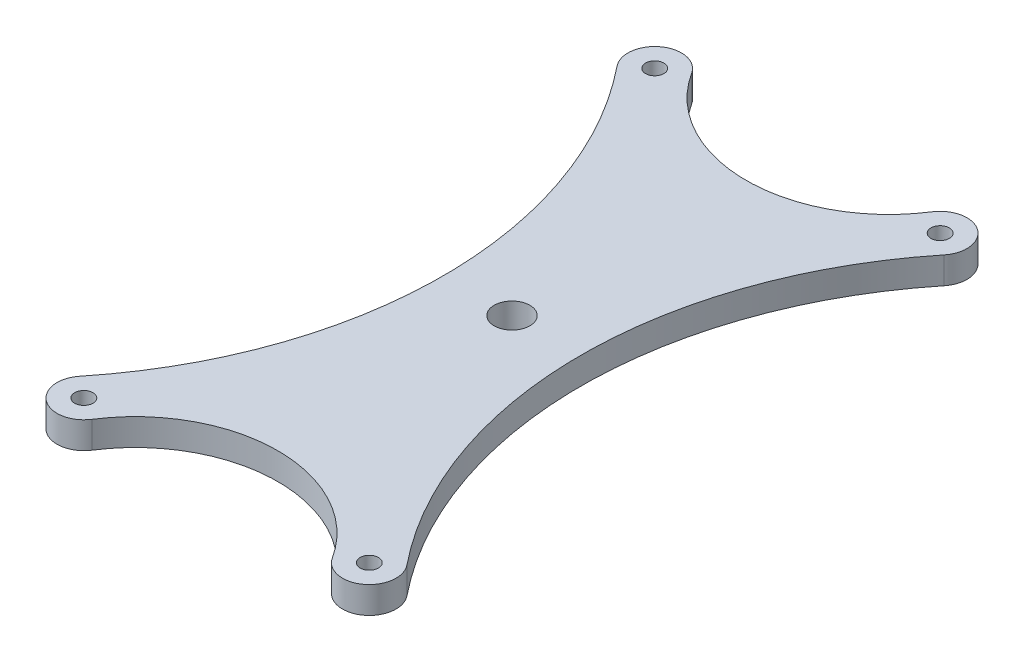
ISO-10303-21;
HEADER;
FILE_DESCRIPTION(('STEP AP214'),'2;1');
FILE_NAME('part.step','',(''),(''),'','','');
FILE_SCHEMA(('AUTOMOTIVE_DESIGN { 1 0 10303 214 1 1 1 1 }'));
ENDSEC;
DATA;
#1=APPLICATION_CONTEXT('core data for automotive mechanical design processes');
#2=APPLICATION_PROTOCOL_DEFINITION('international standard','automotive_design',2000,#1);
#3=PRODUCT_CONTEXT('',#1,'mechanical');
#4=PRODUCT('Part','Part','',(#3));
#5=PRODUCT_RELATED_PRODUCT_CATEGORY('part','',(#4));
#6=PRODUCT_DEFINITION_FORMATION('','',#4);
#7=PRODUCT_DEFINITION_CONTEXT('part definition',#1,'design');
#8=PRODUCT_DEFINITION('design','',#6,#7);
#9=PRODUCT_DEFINITION_SHAPE('','',#8);
#10=(LENGTH_UNIT() NAMED_UNIT(*) SI_UNIT(.MILLI.,.METRE.));
#11=(NAMED_UNIT(*) PLANE_ANGLE_UNIT() SI_UNIT($,.RADIAN.));
#12=(NAMED_UNIT(*) SI_UNIT($,.STERADIAN.) SOLID_ANGLE_UNIT());
#13=UNCERTAINTY_MEASURE_WITH_UNIT(LENGTH_MEASURE(1.E-05),#10,'distance_accuracy_value','');
#14=(GEOMETRIC_REPRESENTATION_CONTEXT(3) GLOBAL_UNCERTAINTY_ASSIGNED_CONTEXT((#13)) GLOBAL_UNIT_ASSIGNED_CONTEXT((#10,
#11,#12)) REPRESENTATION_CONTEXT('',''));
#15=CARTESIAN_POINT('',(0.,0.,0.));
#16=DIRECTION('',(0.,0.,1.));
#17=DIRECTION('',(1.,0.,0.));
#18=AXIS2_PLACEMENT_3D('',#15,#16,#17);
#19=CARTESIAN_POINT('',(-113.841941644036,9.525,50.8));
#20=DIRECTION('',(0.,-1.,0.));
#21=DIRECTION('',(0.,0.,-1.));
#22=AXIS2_PLACEMENT_3D('',#19,#20,#21);
#23=PLANE('',#22);
#24=CARTESIAN_POINT('',(-176.883883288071,9.525,0.));
#25=DIRECTION('',(0.,-1.,0.));
#26=DIRECTION('',(0.,0.,-1.));
#27=AXIS2_PLACEMENT_3D('',#24,#25,#26);
#28=CIRCLE('',#27,152.4);
#29=CARTESIAN_POINT('',(-58.2166990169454,9.525,-95.6235294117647));
#30=VERTEX_POINT('',#29);
#31=CARTESIAN_POINT('',(-58.2166990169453,9.525,95.6235294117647));
#32=VERTEX_POINT('',#31);
#33=EDGE_CURVE('E145',#30,#32,#28,.T.);
#34=ORIENTED_EDGE('',*,*,#33,.T.);
#35=CARTESIAN_POINT('',(-50.8,9.525,101.6));
#36=DIRECTION('',(0.,1.,0.));
#37=DIRECTION('',(0.,0.,1.));
#38=AXIS2_PLACEMENT_3D('',#35,#36,#37);
#39=CIRCLE('',#38,9.525);
#40=CARTESIAN_POINT('',(-42.778947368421,9.525,106.736958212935));
#41=VERTEX_POINT('',#40);
#42=EDGE_CURVE('E93',#32,#41,#39,.T.);
#43=ORIENTED_EDGE('',*,*,#42,.T.);
#44=CARTESIAN_POINT('',(0.,9.525,134.134068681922));
#45=DIRECTION('',(0.,-1.,0.));
#46=DIRECTION('',(0.,0.,-1.));
#47=AXIS2_PLACEMENT_3D('',#44,#45,#46);
#48=CIRCLE('',#47,50.8);
#49=CARTESIAN_POINT('',(42.7789473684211,9.525,106.736958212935));
#50=VERTEX_POINT('',#49);
#51=EDGE_CURVE('E160',#41,#50,#48,.T.);
#52=ORIENTED_EDGE('',*,*,#51,.T.);
#53=CARTESIAN_POINT('',(50.8,9.525,101.6));
#54=DIRECTION('',(0.,1.,0.));
#55=DIRECTION('',(0.,0.,1.));
#56=AXIS2_PLACEMENT_3D('',#53,#54,#55);
#57=CIRCLE('',#56,9.52499999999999);
#58=CARTESIAN_POINT('',(58.2166990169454,9.525,95.6235294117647));
#59=VERTEX_POINT('',#58);
#60=EDGE_CURVE('E173',#50,#59,#57,.T.);
#61=ORIENTED_EDGE('',*,*,#60,.T.);
#62=CARTESIAN_POINT('',(176.883883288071,9.525,0.));
#63=DIRECTION('',(0.,-1.,0.));
#64=DIRECTION('',(0.,0.,1.));
#65=AXIS2_PLACEMENT_3D('',#62,#63,#64);
#66=CIRCLE('',#65,152.4);
#67=CARTESIAN_POINT('',(58.2166990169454,9.525,-95.6235294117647));
#68=VERTEX_POINT('',#67);
#69=EDGE_CURVE('E112',#59,#68,#66,.T.);
#70=ORIENTED_EDGE('',*,*,#69,.T.);
#71=CARTESIAN_POINT('',(50.8,9.525,-101.6));
#72=DIRECTION('',(0.,1.,0.));
#73=DIRECTION('',(0.,0.,1.));
#74=AXIS2_PLACEMENT_3D('',#71,#72,#73);
#75=CIRCLE('',#74,9.525);
#76=CARTESIAN_POINT('',(42.7789473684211,9.525,-106.736958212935));
#77=VERTEX_POINT('',#76);
#78=EDGE_CURVE('E106',#68,#77,#75,.T.);
#79=ORIENTED_EDGE('',*,*,#78,.T.);
#80=CARTESIAN_POINT('',(0.,9.525,-134.134068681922));
#81=DIRECTION('',(0.,-1.,0.));
#82=DIRECTION('',(0.,0.,1.));
#83=AXIS2_PLACEMENT_3D('',#80,#81,#82);
#84=CIRCLE('',#83,50.8);
#85=CARTESIAN_POINT('',(-42.7789473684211,9.525,-106.736958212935));
#86=VERTEX_POINT('',#85);
#87=EDGE_CURVE('E110',#77,#86,#84,.T.);
#88=ORIENTED_EDGE('',*,*,#87,.T.);
#89=CARTESIAN_POINT('',(-50.8,9.525,-101.6));
#90=DIRECTION('',(0.,1.,0.));
#91=DIRECTION('',(0.,0.,1.));
#92=AXIS2_PLACEMENT_3D('',#89,#90,#91);
#93=CIRCLE('',#92,9.525);
#94=EDGE_CURVE('E50',#86,#30,#93,.T.);
#95=ORIENTED_EDGE('',*,*,#94,.T.);
#96=EDGE_LOOP('',(#34,#43,#52,#61,#70,#79,#88,#95));
#97=FACE_BOUND('',#96,.T.);
#98=CARTESIAN_POINT('',(-50.8,9.525,-101.6));
#99=DIRECTION('',(0.,1.,0.));
#100=DIRECTION('',(0.,0.,1.));
#101=AXIS2_PLACEMENT_3D('',#98,#99,#100);
#102=CIRCLE('',#101,3.2639);
#103=CARTESIAN_POINT('',(-50.8,9.525,-104.8639));
#104=VERTEX_POINT('',#103);
#105=EDGE_CURVE('E134',#104,#104,#102,.T.);
#106=ORIENTED_EDGE('',*,*,#105,.F.);
#107=EDGE_LOOP('',(#106));
#108=FACE_BOUND('',#107,.T.);
#109=CARTESIAN_POINT('',(50.8,9.525,-101.6));
#110=DIRECTION('',(0.,1.,0.));
#111=DIRECTION('',(0.,0.,1.));
#112=AXIS2_PLACEMENT_3D('',#109,#110,#111);
#113=CIRCLE('',#112,3.2639);
#114=CARTESIAN_POINT('',(50.8,9.525,-104.8639));
#115=VERTEX_POINT('',#114);
#116=EDGE_CURVE('E182',#115,#115,#113,.T.);
#117=ORIENTED_EDGE('',*,*,#116,.F.);
#118=EDGE_LOOP('',(#117));
#119=FACE_BOUND('',#118,.T.);
#120=CARTESIAN_POINT('',(-50.8,9.525,101.6));
#121=DIRECTION('',(0.,1.,0.));
#122=DIRECTION('',(0.,0.,1.));
#123=AXIS2_PLACEMENT_3D('',#120,#121,#122);
#124=CIRCLE('',#123,3.2639);
#125=CARTESIAN_POINT('',(-50.8,9.525,98.3361));
#126=VERTEX_POINT('',#125);
#127=EDGE_CURVE('E188',#126,#126,#124,.T.);
#128=ORIENTED_EDGE('',*,*,#127,.F.);
#129=EDGE_LOOP('',(#128));
#130=FACE_BOUND('',#129,.T.);
#131=CARTESIAN_POINT('',(50.8,9.525,101.6));
#132=DIRECTION('',(0.,1.,0.));
#133=DIRECTION('',(0.,0.,1.));
#134=AXIS2_PLACEMENT_3D('',#131,#132,#133);
#135=CIRCLE('',#134,3.2639);
#136=CARTESIAN_POINT('',(50.8,9.525,98.3361));
#137=VERTEX_POINT('',#136);
#138=EDGE_CURVE('E194',#137,#137,#135,.T.);
#139=ORIENTED_EDGE('',*,*,#138,.F.);
#140=EDGE_LOOP('',(#139));
#141=FACE_BOUND('',#140,.T.);
#142=CARTESIAN_POINT('',(0.,9.525,0.));
#143=DIRECTION('',(0.,1.,0.));
#144=DIRECTION('',(0.,0.,1.));
#145=AXIS2_PLACEMENT_3D('',#142,#143,#144);
#146=CIRCLE('',#145,6.35);
#147=CARTESIAN_POINT('',(0.,9.525,-6.35000000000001));
#148=VERTEX_POINT('',#147);
#149=EDGE_CURVE('E200',#148,#148,#146,.T.);
#150=ORIENTED_EDGE('',*,*,#149,.F.);
#151=EDGE_LOOP('',(#150));
#152=FACE_BOUND('',#151,.T.);
#153=ADVANCED_FACE('F33',(#97,#108,#119,#130,#141,#152),#23,.F.);
#154=CARTESIAN_POINT('',(-113.841941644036,0.,50.8));
#155=DIRECTION('',(0.,-1.,0.));
#156=DIRECTION('',(0.,0.,-1.));
#157=AXIS2_PLACEMENT_3D('',#154,#155,#156);
#158=PLANE('',#157);
#159=CARTESIAN_POINT('',(50.8,0.,101.6));
#160=DIRECTION('',(0.,1.,0.));
#161=DIRECTION('',(0.,0.,1.));
#162=AXIS2_PLACEMENT_3D('',#159,#160,#161);
#163=CIRCLE('',#162,3.2639);
#164=CARTESIAN_POINT('',(50.8,0.,98.3361));
#165=VERTEX_POINT('',#164);
#166=EDGE_CURVE('E197',#165,#165,#163,.T.);
#167=ORIENTED_EDGE('',*,*,#166,.T.);
#168=EDGE_LOOP('',(#167));
#169=FACE_BOUND('',#168,.T.);
#170=CARTESIAN_POINT('',(50.8,0.,-101.6));
#171=DIRECTION('',(0.,1.,0.));
#172=DIRECTION('',(0.,0.,1.));
#173=AXIS2_PLACEMENT_3D('',#170,#171,#172);
#174=CIRCLE('',#173,3.2639);
#175=CARTESIAN_POINT('',(50.8,0.,-104.8639));
#176=VERTEX_POINT('',#175);
#177=EDGE_CURVE('E185',#176,#176,#174,.T.);
#178=ORIENTED_EDGE('',*,*,#177,.T.);
#179=EDGE_LOOP('',(#178));
#180=FACE_BOUND('',#179,.T.);
#181=CARTESIAN_POINT('',(-176.883883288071,0.,0.));
#182=DIRECTION('',(0.,-1.,0.));
#183=DIRECTION('',(0.,0.,-1.));
#184=AXIS2_PLACEMENT_3D('',#181,#182,#183);
#185=CIRCLE('',#184,152.4);
#186=CARTESIAN_POINT('',(-58.2166990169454,0.,-95.6235294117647));
#187=VERTEX_POINT('',#186);
#188=CARTESIAN_POINT('',(-58.2166990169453,0.,95.6235294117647));
#189=VERTEX_POINT('',#188);
#190=EDGE_CURVE('E130',#187,#189,#185,.T.);
#191=ORIENTED_EDGE('',*,*,#190,.F.);
#192=CARTESIAN_POINT('',(-50.8,0.,-101.6));
#193=DIRECTION('',(0.,1.,0.));
#194=DIRECTION('',(0.,0.,1.));
#195=AXIS2_PLACEMENT_3D('',#192,#193,#194);
#196=CIRCLE('',#195,9.525);
#197=CARTESIAN_POINT('',(-42.7789473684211,0.,-106.736958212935));
#198=VERTEX_POINT('',#197);
#199=EDGE_CURVE('E85',#198,#187,#196,.T.);
#200=ORIENTED_EDGE('',*,*,#199,.F.);
#201=CARTESIAN_POINT('',(0.,0.,-134.134068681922));
#202=DIRECTION('',(0.,-1.,0.));
#203=DIRECTION('',(0.,0.,1.));
#204=AXIS2_PLACEMENT_3D('',#201,#202,#203);
#205=CIRCLE('',#204,50.8);
#206=CARTESIAN_POINT('',(42.7789473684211,0.,-106.736958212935));
#207=VERTEX_POINT('',#206);
#208=EDGE_CURVE('E79',#207,#198,#205,.T.);
#209=ORIENTED_EDGE('',*,*,#208,.F.);
#210=CARTESIAN_POINT('',(50.8,0.,-101.6));
#211=DIRECTION('',(0.,1.,0.));
#212=DIRECTION('',(0.,0.,1.));
#213=AXIS2_PLACEMENT_3D('',#210,#211,#212);
#214=CIRCLE('',#213,9.525);
#215=CARTESIAN_POINT('',(58.2166990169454,0.,-95.6235294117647));
#216=VERTEX_POINT('',#215);
#217=EDGE_CURVE('E120',#216,#207,#214,.T.);
#218=ORIENTED_EDGE('',*,*,#217,.F.);
#219=CARTESIAN_POINT('',(176.883883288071,0.,0.));
#220=DIRECTION('',(0.,-1.,0.));
#221=DIRECTION('',(0.,0.,1.));
#222=AXIS2_PLACEMENT_3D('',#219,#220,#221);
#223=CIRCLE('',#222,152.4);
#224=CARTESIAN_POINT('',(58.2166990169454,0.,95.6235294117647));
#225=VERTEX_POINT('',#224);
#226=EDGE_CURVE('E140',#225,#216,#223,.T.);
#227=ORIENTED_EDGE('',*,*,#226,.F.);
#228=CARTESIAN_POINT('',(50.8,0.,101.6));
#229=DIRECTION('',(0.,1.,0.));
#230=DIRECTION('',(0.,0.,1.));
#231=AXIS2_PLACEMENT_3D('',#228,#229,#230);
#232=CIRCLE('',#231,9.52499999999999);
#233=CARTESIAN_POINT('',(42.7789473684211,0.,106.736958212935));
#234=VERTEX_POINT('',#233);
#235=EDGE_CURVE('E138',#234,#225,#232,.T.);
#236=ORIENTED_EDGE('',*,*,#235,.F.);
#237=CARTESIAN_POINT('',(0.,0.,134.134068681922));
#238=DIRECTION('',(0.,-1.,0.));
#239=DIRECTION('',(0.,0.,-1.));
#240=AXIS2_PLACEMENT_3D('',#237,#238,#239);
#241=CIRCLE('',#240,50.8);
#242=CARTESIAN_POINT('',(-42.778947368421,0.,106.736958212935));
#243=VERTEX_POINT('',#242);
#244=EDGE_CURVE('E136',#243,#234,#241,.T.);
#245=ORIENTED_EDGE('',*,*,#244,.F.);
#246=CARTESIAN_POINT('',(-50.8,0.,101.6));
#247=DIRECTION('',(0.,1.,0.));
#248=DIRECTION('',(0.,0.,1.));
#249=AXIS2_PLACEMENT_3D('',#246,#247,#248);
#250=CIRCLE('',#249,9.525);
#251=EDGE_CURVE('E133',#189,#243,#250,.T.);
#252=ORIENTED_EDGE('',*,*,#251,.F.);
#253=EDGE_LOOP('',(#191,#200,#209,#218,#227,#236,#245,#252));
#254=FACE_BOUND('',#253,.T.);
#255=CARTESIAN_POINT('',(-50.8,0.,-101.6));
#256=DIRECTION('',(0.,1.,0.));
#257=DIRECTION('',(0.,0.,1.));
#258=AXIS2_PLACEMENT_3D('',#255,#256,#257);
#259=CIRCLE('',#258,3.2639);
#260=CARTESIAN_POINT('',(-50.8,0.,-104.8639));
#261=VERTEX_POINT('',#260);
#262=EDGE_CURVE('E179',#261,#261,#259,.T.);
#263=ORIENTED_EDGE('',*,*,#262,.T.);
#264=EDGE_LOOP('',(#263));
#265=FACE_BOUND('',#264,.T.);
#266=CARTESIAN_POINT('',(-50.8,0.,101.6));
#267=DIRECTION('',(0.,1.,0.));
#268=DIRECTION('',(0.,0.,1.));
#269=AXIS2_PLACEMENT_3D('',#266,#267,#268);
#270=CIRCLE('',#269,3.2639);
#271=CARTESIAN_POINT('',(-50.8,0.,98.3361));
#272=VERTEX_POINT('',#271);
#273=EDGE_CURVE('E191',#272,#272,#270,.T.);
#274=ORIENTED_EDGE('',*,*,#273,.T.);
#275=EDGE_LOOP('',(#274));
#276=FACE_BOUND('',#275,.T.);
#277=CARTESIAN_POINT('',(0.,0.,0.));
#278=DIRECTION('',(0.,1.,0.));
#279=DIRECTION('',(0.,0.,1.));
#280=AXIS2_PLACEMENT_3D('',#277,#278,#279);
#281=CIRCLE('',#280,6.35);
#282=CARTESIAN_POINT('',(0.,0.,-6.35000000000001));
#283=VERTEX_POINT('',#282);
#284=EDGE_CURVE('E203',#283,#283,#281,.T.);
#285=ORIENTED_EDGE('',*,*,#284,.T.);
#286=EDGE_LOOP('',(#285));
#287=FACE_BOUND('',#286,.T.);
#288=ADVANCED_FACE('F164',(#169,#180,#254,#265,#276,#287),#158,.T.);
#289=CARTESIAN_POINT('',(-176.883883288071,9.525,0.));
#290=DIRECTION('',(0.,-1.,0.));
#291=DIRECTION('',(0.,0.,-1.));
#292=AXIS2_PLACEMENT_3D('',#289,#290,#291);
#293=CYLINDRICAL_SURFACE('',#292,152.4);
#294=ORIENTED_EDGE('',*,*,#190,.T.);
#295=DIRECTION('',(0.,-1.,0.));
#296=VECTOR('',#295,1.);
#297=CARTESIAN_POINT('',(-58.2166990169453,9.525,95.6235294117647));
#298=LINE('',#297,#296);
#299=EDGE_CURVE('E11',#32,#189,#298,.T.);
#300=ORIENTED_EDGE('',*,*,#299,.F.);
#301=ORIENTED_EDGE('',*,*,#33,.F.);
#302=DIRECTION('',(0.,-1.,0.));
#303=VECTOR('',#302,1.);
#304=CARTESIAN_POINT('',(-58.2166990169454,9.525,-95.6235294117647));
#305=LINE('',#304,#303);
#306=EDGE_CURVE('E126',#30,#187,#305,.T.);
#307=ORIENTED_EDGE('',*,*,#306,.T.);
#308=EDGE_LOOP('',(#294,#300,#301,#307));
#309=FACE_BOUND('',#308,.T.);
#310=ADVANCED_FACE('F35',(#309),#293,.F.);
#311=CARTESIAN_POINT('',(-50.8,9.525,101.6));
#312=DIRECTION('',(0.,-1.,0.));
#313=DIRECTION('',(0.,0.,-1.));
#314=AXIS2_PLACEMENT_3D('',#311,#312,#313);
#315=CYLINDRICAL_SURFACE('',#314,9.525);
#316=ORIENTED_EDGE('',*,*,#251,.T.);
#317=DIRECTION('',(0.,-1.,0.));
#318=VECTOR('',#317,1.);
#319=CARTESIAN_POINT('',(-42.778947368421,9.525,106.736958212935));
#320=LINE('',#319,#318);
#321=EDGE_CURVE('E42',#41,#243,#320,.T.);
#322=ORIENTED_EDGE('',*,*,#321,.F.);
#323=ORIENTED_EDGE('',*,*,#42,.F.);
#324=ORIENTED_EDGE('',*,*,#299,.T.);
#325=EDGE_LOOP('',(#316,#322,#323,#324));
#326=FACE_BOUND('',#325,.T.);
#327=ADVANCED_FACE('F235',(#326),#315,.T.);
#328=CARTESIAN_POINT('',(0.,9.525,134.134068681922));
#329=DIRECTION('',(0.,-1.,0.));
#330=DIRECTION('',(0.,0.,-1.));
#331=AXIS2_PLACEMENT_3D('',#328,#329,#330);
#332=CYLINDRICAL_SURFACE('',#331,50.8);
#333=ORIENTED_EDGE('',*,*,#244,.T.);
#334=DIRECTION('',(0.,-1.,0.));
#335=VECTOR('',#334,1.);
#336=CARTESIAN_POINT('',(42.7789473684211,9.525,106.736958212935));
#337=LINE('',#336,#335);
#338=EDGE_CURVE('E152',#50,#234,#337,.T.);
#339=ORIENTED_EDGE('',*,*,#338,.F.);
#340=ORIENTED_EDGE('',*,*,#51,.F.);
#341=ORIENTED_EDGE('',*,*,#321,.T.);
#342=EDGE_LOOP('',(#333,#339,#340,#341));
#343=FACE_BOUND('',#342,.T.);
#344=ADVANCED_FACE('F158',(#343),#332,.F.);
#345=CARTESIAN_POINT('',(50.8,9.525,101.6));
#346=DIRECTION('',(0.,-1.,0.));
#347=DIRECTION('',(0.,0.,-1.));
#348=AXIS2_PLACEMENT_3D('',#345,#346,#347);
#349=CYLINDRICAL_SURFACE('',#348,9.52499999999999);
#350=ORIENTED_EDGE('',*,*,#235,.T.);
#351=DIRECTION('',(0.,-1.,0.));
#352=VECTOR('',#351,1.);
#353=CARTESIAN_POINT('',(58.2166990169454,9.525,95.6235294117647));
#354=LINE('',#353,#352);
#355=EDGE_CURVE('E149',#59,#225,#354,.T.);
#356=ORIENTED_EDGE('',*,*,#355,.F.);
#357=ORIENTED_EDGE('',*,*,#60,.F.);
#358=ORIENTED_EDGE('',*,*,#338,.T.);
#359=EDGE_LOOP('',(#350,#356,#357,#358));
#360=FACE_BOUND('',#359,.T.);
#361=ADVANCED_FACE('F169',(#360),#349,.T.);
#362=CARTESIAN_POINT('',(176.883883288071,9.525,0.));
#363=DIRECTION('',(0.,-1.,0.));
#364=DIRECTION('',(0.,0.,-1.));
#365=AXIS2_PLACEMENT_3D('',#362,#363,#364);
#366=CYLINDRICAL_SURFACE('',#365,152.4);
#367=ORIENTED_EDGE('',*,*,#226,.T.);
#368=DIRECTION('',(0.,-1.,0.));
#369=VECTOR('',#368,1.);
#370=CARTESIAN_POINT('',(58.2166990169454,9.525,-95.6235294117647));
#371=LINE('',#370,#369);
#372=EDGE_CURVE('E121',#68,#216,#371,.T.);
#373=ORIENTED_EDGE('',*,*,#372,.F.);
#374=ORIENTED_EDGE('',*,*,#69,.F.);
#375=ORIENTED_EDGE('',*,*,#355,.T.);
#376=EDGE_LOOP('',(#367,#373,#374,#375));
#377=FACE_BOUND('',#376,.T.);
#378=ADVANCED_FACE('F172',(#377),#366,.F.);
#379=CARTESIAN_POINT('',(50.8,9.525,-101.6));
#380=DIRECTION('',(0.,-1.,0.));
#381=DIRECTION('',(0.,0.,-1.));
#382=AXIS2_PLACEMENT_3D('',#379,#380,#381);
#383=CYLINDRICAL_SURFACE('',#382,9.525);
#384=ORIENTED_EDGE('',*,*,#217,.T.);
#385=DIRECTION('',(0.,-1.,0.));
#386=VECTOR('',#385,1.);
#387=CARTESIAN_POINT('',(42.7789473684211,9.525,-106.736958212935));
#388=LINE('',#387,#386);
#389=EDGE_CURVE('E117',#77,#207,#388,.T.);
#390=ORIENTED_EDGE('',*,*,#389,.F.);
#391=ORIENTED_EDGE('',*,*,#78,.F.);
#392=ORIENTED_EDGE('',*,*,#372,.T.);
#393=EDGE_LOOP('',(#384,#390,#391,#392));
#394=FACE_BOUND('',#393,.T.);
#395=ADVANCED_FACE('F118',(#394),#383,.T.);
#396=CARTESIAN_POINT('',(0.,9.525,-134.134068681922));
#397=DIRECTION('',(0.,-1.,0.));
#398=DIRECTION('',(0.,0.,-1.));
#399=AXIS2_PLACEMENT_3D('',#396,#397,#398);
#400=CYLINDRICAL_SURFACE('',#399,50.8);
#401=ORIENTED_EDGE('',*,*,#208,.T.);
#402=DIRECTION('',(0.,-1.,0.));
#403=VECTOR('',#402,1.);
#404=CARTESIAN_POINT('',(-42.7789473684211,9.525,-106.736958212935));
#405=LINE('',#404,#403);
#406=EDGE_CURVE('E122',#86,#198,#405,.T.);
#407=ORIENTED_EDGE('',*,*,#406,.F.);
#408=ORIENTED_EDGE('',*,*,#87,.F.);
#409=ORIENTED_EDGE('',*,*,#389,.T.);
#410=EDGE_LOOP('',(#401,#407,#408,#409));
#411=FACE_BOUND('',#410,.T.);
#412=ADVANCED_FACE('F124',(#411),#400,.F.);
#413=CARTESIAN_POINT('',(-50.8,9.525,-101.6));
#414=DIRECTION('',(0.,-1.,0.));
#415=DIRECTION('',(0.,0.,-1.));
#416=AXIS2_PLACEMENT_3D('',#413,#414,#415);
#417=CYLINDRICAL_SURFACE('',#416,9.525);
#418=ORIENTED_EDGE('',*,*,#199,.T.);
#419=ORIENTED_EDGE('',*,*,#306,.F.);
#420=ORIENTED_EDGE('',*,*,#94,.F.);
#421=ORIENTED_EDGE('',*,*,#406,.T.);
#422=EDGE_LOOP('',(#418,#419,#420,#421));
#423=FACE_BOUND('',#422,.T.);
#424=ADVANCED_FACE('F223',(#423),#417,.T.);
#425=CARTESIAN_POINT('',(-50.8,9.525,-101.6));
#426=DIRECTION('',(0.,-1.,0.));
#427=DIRECTION('',(0.,0.,-1.));
#428=AXIS2_PLACEMENT_3D('',#425,#426,#427);
#429=CYLINDRICAL_SURFACE('',#428,3.2639);
#430=CARTESIAN_POINT('',(-50.8,9.525,-104.8639));
#431=CARTESIAN_POINT('',(-50.8,9.42578125,-104.8639));
#432=CARTESIAN_POINT('',(-50.8,9.3265625,-104.8639));
#433=CARTESIAN_POINT('',(-50.8,9.128125,-104.8639));
#434=CARTESIAN_POINT('',(-50.8,9.02890625,-104.8639));
#435=CARTESIAN_POINT('',(-50.8,8.83046875,-104.8639));
#436=CARTESIAN_POINT('',(-50.8,8.73125,-104.8639));
#437=CARTESIAN_POINT('',(-50.8,8.5328125,-104.8639));
#438=CARTESIAN_POINT('',(-50.8,8.43359375,-104.8639));
#439=CARTESIAN_POINT('',(-50.8,8.23515625,-104.8639));
#440=CARTESIAN_POINT('',(-50.8,8.1359375,-104.8639));
#441=CARTESIAN_POINT('',(-50.8,7.9375,-104.8639));
#442=CARTESIAN_POINT('',(-50.8,7.83828125,-104.8639));
#443=CARTESIAN_POINT('',(-50.8,7.63984375,-104.8639));
#444=CARTESIAN_POINT('',(-50.8,7.540625,-104.8639));
#445=CARTESIAN_POINT('',(-50.8,7.3421875,-104.8639));
#446=CARTESIAN_POINT('',(-50.8,7.24296875,-104.8639));
#447=CARTESIAN_POINT('',(-50.8,7.04453125,-104.8639));
#448=CARTESIAN_POINT('',(-50.8,6.9453125,-104.8639));
#449=CARTESIAN_POINT('',(-50.8,6.746875,-104.8639));
#450=CARTESIAN_POINT('',(-50.8,6.64765625,-104.8639));
#451=CARTESIAN_POINT('',(-50.8,6.44921875,-104.8639));
#452=CARTESIAN_POINT('',(-50.8,6.35,-104.8639));
#453=CARTESIAN_POINT('',(-50.8,6.1515625,-104.8639));
#454=CARTESIAN_POINT('',(-50.8,6.05234375,-104.8639));
#455=CARTESIAN_POINT('',(-50.8,5.85390625,-104.8639));
#456=CARTESIAN_POINT('',(-50.8,5.7546875,-104.8639));
#457=CARTESIAN_POINT('',(-50.8,5.55625,-104.8639));
#458=CARTESIAN_POINT('',(-50.8,5.45703125,-104.8639));
#459=CARTESIAN_POINT('',(-50.8,5.25859375,-104.8639));
#460=CARTESIAN_POINT('',(-50.8,5.159375,-104.8639));
#461=CARTESIAN_POINT('',(-50.8,4.9609375,-104.8639));
#462=CARTESIAN_POINT('',(-50.8,4.86171875,-104.8639));
#463=CARTESIAN_POINT('',(-50.8,4.66328125,-104.8639));
#464=CARTESIAN_POINT('',(-50.8,4.5640625,-104.8639));
#465=CARTESIAN_POINT('',(-50.8,4.365625,-104.8639));
#466=CARTESIAN_POINT('',(-50.8,4.26640625,-104.8639));
#467=CARTESIAN_POINT('',(-50.8,4.06796875,-104.8639));
#468=CARTESIAN_POINT('',(-50.8,3.96875,-104.8639));
#469=CARTESIAN_POINT('',(-50.8,3.7703125,-104.8639));
#470=CARTESIAN_POINT('',(-50.8,3.67109375,-104.8639));
#471=CARTESIAN_POINT('',(-50.8,3.47265625,-104.8639));
#472=CARTESIAN_POINT('',(-50.8,3.3734375,-104.8639));
#473=CARTESIAN_POINT('',(-50.8,3.175,-104.8639));
#474=CARTESIAN_POINT('',(-50.8,3.07578125,-104.8639));
#475=CARTESIAN_POINT('',(-50.8,2.87734375,-104.8639));
#476=CARTESIAN_POINT('',(-50.8,2.778125,-104.8639));
#477=CARTESIAN_POINT('',(-50.8,2.5796875,-104.8639));
#478=CARTESIAN_POINT('',(-50.8,2.48046875,-104.8639));
#479=CARTESIAN_POINT('',(-50.8,2.28203125,-104.8639));
#480=CARTESIAN_POINT('',(-50.8,2.1828125,-104.8639));
#481=CARTESIAN_POINT('',(-50.8,1.984375,-104.8639));
#482=CARTESIAN_POINT('',(-50.8,1.88515625,-104.8639));
#483=CARTESIAN_POINT('',(-50.8,1.68671875,-104.8639));
#484=CARTESIAN_POINT('',(-50.8,1.5875,-104.8639));
#485=CARTESIAN_POINT('',(-50.8,1.3890625,-104.8639));
#486=CARTESIAN_POINT('',(-50.8,1.28984375,-104.8639));
#487=CARTESIAN_POINT('',(-50.8,1.09140625,-104.8639));
#488=CARTESIAN_POINT('',(-50.8,0.992187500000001,-104.8639));
#489=CARTESIAN_POINT('',(-50.8,0.793750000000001,-104.8639));
#490=CARTESIAN_POINT('',(-50.8,0.69453125,-104.8639));
#491=CARTESIAN_POINT('',(-50.8,0.49609375,-104.8639));
#492=CARTESIAN_POINT('',(-50.8,0.396875,-104.8639));
#493=CARTESIAN_POINT('',(-50.8,0.1984375,-104.8639));
#494=CARTESIAN_POINT('',(-50.8,0.0992187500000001,-104.8639));
#495=CARTESIAN_POINT('',(-50.8,0.,-104.8639));
#496=B_SPLINE_CURVE_WITH_KNOTS('',3,(#430,#431,#432,#433,#434,#435,#436,#437,#438,#439,#440,
#441,#442,#443,#444,#445,#446,#447,#448,#449,#450,#451,#452,#453,#454,#455,#456,#457,#458,#459,
#460,#461,#462,#463,#464,#465,#466,#467,#468,#469,#470,#471,#472,#473,#474,#475,#476,#477,#478,
#479,#480,#481,#482,#483,#484,#485,#486,#487,#488,#489,#490,#491,#492,#493,#494,#495),
.UNSPECIFIED.,.F.,.F.,(4,2,2,2,2,2,2,2,2,2,2,2,2,2,2,2,2,2,2,2,2,2,2,2,2,2,2,2,2,2,2,2,4),(0.,
0.29765625,0.5953125,0.892968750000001,1.190625,1.48828125,1.7859375,2.08359375,2.38125,
2.67890625,2.9765625,3.27421875,3.571875,3.86953125,4.1671875,4.46484375,4.7625,5.06015625,
5.3578125,5.65546875,5.953125,6.25078125,6.5484375,6.84609375,7.14375,7.44140625,7.7390625,
8.03671875,8.334375,8.63203125,8.9296875,9.22734375,9.525),.UNSPECIFIED.);
#497=EDGE_CURVE('BSEAM220',#104,#261,#496,.T.);
#498=ORIENTED_EDGE('',*,*,#105,.T.);
#499=ORIENTED_EDGE('',*,*,#262,.F.);
#500=ORIENTED_EDGE('',*,*,#497,.T.);
#501=ORIENTED_EDGE('',*,*,#497,.F.);
#502=EDGE_LOOP('',(#498,#500,#499,#501));
#503=FACE_BOUND('',#502,.T.);
#504=ADVANCED_FACE('F220',(#503),#429,.F.);
#505=CARTESIAN_POINT('',(50.8,9.525,-101.6));
#506=DIRECTION('',(0.,-1.,0.));
#507=DIRECTION('',(0.,0.,-1.));
#508=AXIS2_PLACEMENT_3D('',#505,#506,#507);
#509=CYLINDRICAL_SURFACE('',#508,3.2639);
#510=CARTESIAN_POINT('',(50.8,9.525,-104.8639));
#511=CARTESIAN_POINT('',(50.8,9.42578125,-104.8639));
#512=CARTESIAN_POINT('',(50.8,9.3265625,-104.8639));
#513=CARTESIAN_POINT('',(50.8,9.128125,-104.8639));
#514=CARTESIAN_POINT('',(50.8,9.02890625,-104.8639));
#515=CARTESIAN_POINT('',(50.8,8.83046875,-104.8639));
#516=CARTESIAN_POINT('',(50.8,8.73125,-104.8639));
#517=CARTESIAN_POINT('',(50.8,8.5328125,-104.8639));
#518=CARTESIAN_POINT('',(50.8,8.43359375,-104.8639));
#519=CARTESIAN_POINT('',(50.8,8.23515625,-104.8639));
#520=CARTESIAN_POINT('',(50.8,8.1359375,-104.8639));
#521=CARTESIAN_POINT('',(50.8,7.9375,-104.8639));
#522=CARTESIAN_POINT('',(50.8,7.83828125,-104.8639));
#523=CARTESIAN_POINT('',(50.8,7.63984375,-104.8639));
#524=CARTESIAN_POINT('',(50.8,7.540625,-104.8639));
#525=CARTESIAN_POINT('',(50.8,7.3421875,-104.8639));
#526=CARTESIAN_POINT('',(50.8,7.24296875,-104.8639));
#527=CARTESIAN_POINT('',(50.8,7.04453125,-104.8639));
#528=CARTESIAN_POINT('',(50.8,6.9453125,-104.8639));
#529=CARTESIAN_POINT('',(50.8,6.746875,-104.8639));
#530=CARTESIAN_POINT('',(50.8,6.64765625,-104.8639));
#531=CARTESIAN_POINT('',(50.8,6.44921875,-104.8639));
#532=CARTESIAN_POINT('',(50.8,6.35,-104.8639));
#533=CARTESIAN_POINT('',(50.8,6.1515625,-104.8639));
#534=CARTESIAN_POINT('',(50.8,6.05234375,-104.8639));
#535=CARTESIAN_POINT('',(50.8,5.85390625,-104.8639));
#536=CARTESIAN_POINT('',(50.8,5.7546875,-104.8639));
#537=CARTESIAN_POINT('',(50.8,5.55625,-104.8639));
#538=CARTESIAN_POINT('',(50.8,5.45703125,-104.8639));
#539=CARTESIAN_POINT('',(50.8,5.25859375,-104.8639));
#540=CARTESIAN_POINT('',(50.8,5.159375,-104.8639));
#541=CARTESIAN_POINT('',(50.8,4.9609375,-104.8639));
#542=CARTESIAN_POINT('',(50.8,4.86171875,-104.8639));
#543=CARTESIAN_POINT('',(50.8,4.66328125,-104.8639));
#544=CARTESIAN_POINT('',(50.8,4.5640625,-104.8639));
#545=CARTESIAN_POINT('',(50.8,4.365625,-104.8639));
#546=CARTESIAN_POINT('',(50.8,4.26640625,-104.8639));
#547=CARTESIAN_POINT('',(50.8,4.06796875,-104.8639));
#548=CARTESIAN_POINT('',(50.8,3.96875,-104.8639));
#549=CARTESIAN_POINT('',(50.8,3.7703125,-104.8639));
#550=CARTESIAN_POINT('',(50.8,3.67109375,-104.8639));
#551=CARTESIAN_POINT('',(50.8,3.47265625,-104.8639));
#552=CARTESIAN_POINT('',(50.8,3.3734375,-104.8639));
#553=CARTESIAN_POINT('',(50.8,3.175,-104.8639));
#554=CARTESIAN_POINT('',(50.8,3.07578125,-104.8639));
#555=CARTESIAN_POINT('',(50.8,2.87734375,-104.8639));
#556=CARTESIAN_POINT('',(50.8,2.778125,-104.8639));
#557=CARTESIAN_POINT('',(50.8,2.5796875,-104.8639));
#558=CARTESIAN_POINT('',(50.8,2.48046875,-104.8639));
#559=CARTESIAN_POINT('',(50.8,2.28203125,-104.8639));
#560=CARTESIAN_POINT('',(50.8,2.1828125,-104.8639));
#561=CARTESIAN_POINT('',(50.8,1.984375,-104.8639));
#562=CARTESIAN_POINT('',(50.8,1.88515625,-104.8639));
#563=CARTESIAN_POINT('',(50.8,1.68671875,-104.8639));
#564=CARTESIAN_POINT('',(50.8,1.5875,-104.8639));
#565=CARTESIAN_POINT('',(50.8,1.3890625,-104.8639));
#566=CARTESIAN_POINT('',(50.8,1.28984375,-104.8639));
#567=CARTESIAN_POINT('',(50.8,1.09140625,-104.8639));
#568=CARTESIAN_POINT('',(50.8,0.992187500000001,-104.8639));
#569=CARTESIAN_POINT('',(50.8,0.793750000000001,-104.8639));
#570=CARTESIAN_POINT('',(50.8,0.69453125,-104.8639));
#571=CARTESIAN_POINT('',(50.8,0.49609375,-104.8639));
#572=CARTESIAN_POINT('',(50.8,0.396875,-104.8639));
#573=CARTESIAN_POINT('',(50.8,0.1984375,-104.8639));
#574=CARTESIAN_POINT('',(50.8,0.0992187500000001,-104.8639));
#575=CARTESIAN_POINT('',(50.8,0.,-104.8639));
#576=B_SPLINE_CURVE_WITH_KNOTS('',3,(#510,#511,#512,#513,#514,#515,#516,#517,#518,#519,#520,
#521,#522,#523,#524,#525,#526,#527,#528,#529,#530,#531,#532,#533,#534,#535,#536,#537,#538,#539,
#540,#541,#542,#543,#544,#545,#546,#547,#548,#549,#550,#551,#552,#553,#554,#555,#556,#557,#558,
#559,#560,#561,#562,#563,#564,#565,#566,#567,#568,#569,#570,#571,#572,#573,#574,#575),
.UNSPECIFIED.,.F.,.F.,(4,2,2,2,2,2,2,2,2,2,2,2,2,2,2,2,2,2,2,2,2,2,2,2,2,2,2,2,2,2,2,2,4),(0.,
0.29765625,0.5953125,0.892968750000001,1.190625,1.48828125,1.7859375,2.08359375,2.38125,
2.67890625,2.9765625,3.27421875,3.571875,3.86953125,4.1671875,4.46484375,4.7625,5.06015625,
5.3578125,5.65546875,5.953125,6.25078125,6.5484375,6.84609375,7.14375,7.44140625,7.7390625,
8.03671875,8.334375,8.63203125,8.9296875,9.22734375,9.525),.UNSPECIFIED.);
#577=EDGE_CURVE('BSEAM299',#115,#176,#576,.T.);
#578=ORIENTED_EDGE('',*,*,#116,.T.);
#579=ORIENTED_EDGE('',*,*,#177,.F.);
#580=ORIENTED_EDGE('',*,*,#577,.T.);
#581=ORIENTED_EDGE('',*,*,#577,.F.);
#582=EDGE_LOOP('',(#578,#580,#579,#581));
#583=FACE_BOUND('',#582,.T.);
#584=ADVANCED_FACE('F299',(#583),#509,.F.);
#585=CARTESIAN_POINT('',(-50.8,9.525,101.6));
#586=DIRECTION('',(0.,-1.,0.));
#587=DIRECTION('',(0.,0.,-1.));
#588=AXIS2_PLACEMENT_3D('',#585,#586,#587);
#589=CYLINDRICAL_SURFACE('',#588,3.2639);
#590=CARTESIAN_POINT('',(-50.8,9.525,98.3361));
#591=CARTESIAN_POINT('',(-50.8,9.42578125,98.3361));
#592=CARTESIAN_POINT('',(-50.8,9.3265625,98.3361));
#593=CARTESIAN_POINT('',(-50.8,9.128125,98.3361));
#594=CARTESIAN_POINT('',(-50.8,9.02890625,98.3361));
#595=CARTESIAN_POINT('',(-50.8,8.83046875,98.3361));
#596=CARTESIAN_POINT('',(-50.8,8.73125,98.3361));
#597=CARTESIAN_POINT('',(-50.8,8.5328125,98.3361));
#598=CARTESIAN_POINT('',(-50.8,8.43359375,98.3361));
#599=CARTESIAN_POINT('',(-50.8,8.23515625,98.3361));
#600=CARTESIAN_POINT('',(-50.8,8.1359375,98.3361));
#601=CARTESIAN_POINT('',(-50.8,7.9375,98.3361));
#602=CARTESIAN_POINT('',(-50.8,7.83828125,98.3361));
#603=CARTESIAN_POINT('',(-50.8,7.63984375,98.3361));
#604=CARTESIAN_POINT('',(-50.8,7.540625,98.3361));
#605=CARTESIAN_POINT('',(-50.8,7.3421875,98.3361));
#606=CARTESIAN_POINT('',(-50.8,7.24296875,98.3361));
#607=CARTESIAN_POINT('',(-50.8,7.04453125,98.3361));
#608=CARTESIAN_POINT('',(-50.8,6.9453125,98.3361));
#609=CARTESIAN_POINT('',(-50.8,6.746875,98.3361));
#610=CARTESIAN_POINT('',(-50.8,6.64765625,98.3361));
#611=CARTESIAN_POINT('',(-50.8,6.44921875,98.3361));
#612=CARTESIAN_POINT('',(-50.8,6.35,98.3361));
#613=CARTESIAN_POINT('',(-50.8,6.1515625,98.3361));
#614=CARTESIAN_POINT('',(-50.8,6.05234375,98.3361));
#615=CARTESIAN_POINT('',(-50.8,5.85390625,98.3361));
#616=CARTESIAN_POINT('',(-50.8,5.7546875,98.3361));
#617=CARTESIAN_POINT('',(-50.8,5.55625,98.3361));
#618=CARTESIAN_POINT('',(-50.8,5.45703125,98.3361));
#619=CARTESIAN_POINT('',(-50.8,5.25859375,98.3361));
#620=CARTESIAN_POINT('',(-50.8,5.159375,98.3361));
#621=CARTESIAN_POINT('',(-50.8,4.9609375,98.3361));
#622=CARTESIAN_POINT('',(-50.8,4.86171875,98.3361));
#623=CARTESIAN_POINT('',(-50.8,4.66328125,98.3361));
#624=CARTESIAN_POINT('',(-50.8,4.5640625,98.3361));
#625=CARTESIAN_POINT('',(-50.8,4.365625,98.3361));
#626=CARTESIAN_POINT('',(-50.8,4.26640625,98.3361));
#627=CARTESIAN_POINT('',(-50.8,4.06796875,98.3361));
#628=CARTESIAN_POINT('',(-50.8,3.96875,98.3361));
#629=CARTESIAN_POINT('',(-50.8,3.7703125,98.3361));
#630=CARTESIAN_POINT('',(-50.8,3.67109375,98.3361));
#631=CARTESIAN_POINT('',(-50.8,3.47265625,98.3361));
#632=CARTESIAN_POINT('',(-50.8,3.3734375,98.3361));
#633=CARTESIAN_POINT('',(-50.8,3.175,98.3361));
#634=CARTESIAN_POINT('',(-50.8,3.07578125,98.3361));
#635=CARTESIAN_POINT('',(-50.8,2.87734375,98.3361));
#636=CARTESIAN_POINT('',(-50.8,2.778125,98.3361));
#637=CARTESIAN_POINT('',(-50.8,2.5796875,98.3361));
#638=CARTESIAN_POINT('',(-50.8,2.48046875,98.3361));
#639=CARTESIAN_POINT('',(-50.8,2.28203125,98.3361));
#640=CARTESIAN_POINT('',(-50.8,2.1828125,98.3361));
#641=CARTESIAN_POINT('',(-50.8,1.984375,98.3361));
#642=CARTESIAN_POINT('',(-50.8,1.88515625,98.3361));
#643=CARTESIAN_POINT('',(-50.8,1.68671875,98.3361));
#644=CARTESIAN_POINT('',(-50.8,1.5875,98.3361));
#645=CARTESIAN_POINT('',(-50.8,1.3890625,98.3361));
#646=CARTESIAN_POINT('',(-50.8,1.28984375,98.3361));
#647=CARTESIAN_POINT('',(-50.8,1.09140625,98.3361));
#648=CARTESIAN_POINT('',(-50.8,0.992187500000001,98.3361));
#649=CARTESIAN_POINT('',(-50.8,0.793750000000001,98.3361));
#650=CARTESIAN_POINT('',(-50.8,0.69453125,98.3361));
#651=CARTESIAN_POINT('',(-50.8,0.49609375,98.3361));
#652=CARTESIAN_POINT('',(-50.8,0.396875,98.3361));
#653=CARTESIAN_POINT('',(-50.8,0.1984375,98.3361));
#654=CARTESIAN_POINT('',(-50.8,0.0992187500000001,98.3361));
#655=CARTESIAN_POINT('',(-50.8,0.,98.3361));
#656=B_SPLINE_CURVE_WITH_KNOTS('',3,(#590,#591,#592,#593,#594,#595,#596,#597,#598,#599,#600,
#601,#602,#603,#604,#605,#606,#607,#608,#609,#610,#611,#612,#613,#614,#615,#616,#617,#618,#619,
#620,#621,#622,#623,#624,#625,#626,#627,#628,#629,#630,#631,#632,#633,#634,#635,#636,#637,#638,
#639,#640,#641,#642,#643,#644,#645,#646,#647,#648,#649,#650,#651,#652,#653,#654,#655),
.UNSPECIFIED.,.F.,.F.,(4,2,2,2,2,2,2,2,2,2,2,2,2,2,2,2,2,2,2,2,2,2,2,2,2,2,2,2,2,2,2,2,4),(0.,
0.29765625,0.5953125,0.892968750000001,1.190625,1.48828125,1.7859375,2.08359375,2.38125,
2.67890625,2.9765625,3.27421875,3.571875,3.86953125,4.1671875,4.46484375,4.7625,5.06015625,
5.3578125,5.65546875,5.953125,6.25078125,6.5484375,6.84609375,7.14375,7.44140625,7.7390625,
8.03671875,8.334375,8.63203125,8.9296875,9.22734375,9.525),.UNSPECIFIED.);
#657=EDGE_CURVE('BSEAM307',#126,#272,#656,.T.);
#658=ORIENTED_EDGE('',*,*,#127,.T.);
#659=ORIENTED_EDGE('',*,*,#273,.F.);
#660=ORIENTED_EDGE('',*,*,#657,.T.);
#661=ORIENTED_EDGE('',*,*,#657,.F.);
#662=EDGE_LOOP('',(#658,#660,#659,#661));
#663=FACE_BOUND('',#662,.T.);
#664=ADVANCED_FACE('F307',(#663),#589,.F.);
#665=CARTESIAN_POINT('',(50.8,9.525,101.6));
#666=DIRECTION('',(0.,-1.,0.));
#667=DIRECTION('',(0.,0.,-1.));
#668=AXIS2_PLACEMENT_3D('',#665,#666,#667);
#669=CYLINDRICAL_SURFACE('',#668,3.2639);
#670=CARTESIAN_POINT('',(50.8,9.525,98.3361));
#671=CARTESIAN_POINT('',(50.8,9.42578125,98.3361));
#672=CARTESIAN_POINT('',(50.8,9.3265625,98.3361));
#673=CARTESIAN_POINT('',(50.8,9.128125,98.3361));
#674=CARTESIAN_POINT('',(50.8,9.02890625,98.3361));
#675=CARTESIAN_POINT('',(50.8,8.83046875,98.3361));
#676=CARTESIAN_POINT('',(50.8,8.73125,98.3361));
#677=CARTESIAN_POINT('',(50.8,8.5328125,98.3361));
#678=CARTESIAN_POINT('',(50.8,8.43359375,98.3361));
#679=CARTESIAN_POINT('',(50.8,8.23515625,98.3361));
#680=CARTESIAN_POINT('',(50.8,8.1359375,98.3361));
#681=CARTESIAN_POINT('',(50.8,7.9375,98.3361));
#682=CARTESIAN_POINT('',(50.8,7.83828125,98.3361));
#683=CARTESIAN_POINT('',(50.8,7.63984375,98.3361));
#684=CARTESIAN_POINT('',(50.8,7.540625,98.3361));
#685=CARTESIAN_POINT('',(50.8,7.3421875,98.3361));
#686=CARTESIAN_POINT('',(50.8,7.24296875,98.3361));
#687=CARTESIAN_POINT('',(50.8,7.04453125,98.3361));
#688=CARTESIAN_POINT('',(50.8,6.9453125,98.3361));
#689=CARTESIAN_POINT('',(50.8,6.746875,98.3361));
#690=CARTESIAN_POINT('',(50.8,6.64765625,98.3361));
#691=CARTESIAN_POINT('',(50.8,6.44921875,98.3361));
#692=CARTESIAN_POINT('',(50.8,6.35,98.3361));
#693=CARTESIAN_POINT('',(50.8,6.1515625,98.3361));
#694=CARTESIAN_POINT('',(50.8,6.05234375,98.3361));
#695=CARTESIAN_POINT('',(50.8,5.85390625,98.3361));
#696=CARTESIAN_POINT('',(50.8,5.7546875,98.3361));
#697=CARTESIAN_POINT('',(50.8,5.55625,98.3361));
#698=CARTESIAN_POINT('',(50.8,5.45703125,98.3361));
#699=CARTESIAN_POINT('',(50.8,5.25859375,98.3361));
#700=CARTESIAN_POINT('',(50.8,5.159375,98.3361));
#701=CARTESIAN_POINT('',(50.8,4.9609375,98.3361));
#702=CARTESIAN_POINT('',(50.8,4.86171875,98.3361));
#703=CARTESIAN_POINT('',(50.8,4.66328125,98.3361));
#704=CARTESIAN_POINT('',(50.8,4.5640625,98.3361));
#705=CARTESIAN_POINT('',(50.8,4.365625,98.3361));
#706=CARTESIAN_POINT('',(50.8,4.26640625,98.3361));
#707=CARTESIAN_POINT('',(50.8,4.06796875,98.3361));
#708=CARTESIAN_POINT('',(50.8,3.96875,98.3361));
#709=CARTESIAN_POINT('',(50.8,3.7703125,98.3361));
#710=CARTESIAN_POINT('',(50.8,3.67109375,98.3361));
#711=CARTESIAN_POINT('',(50.8,3.47265625,98.3361));
#712=CARTESIAN_POINT('',(50.8,3.3734375,98.3361));
#713=CARTESIAN_POINT('',(50.8,3.175,98.3361));
#714=CARTESIAN_POINT('',(50.8,3.07578125,98.3361));
#715=CARTESIAN_POINT('',(50.8,2.87734375,98.3361));
#716=CARTESIAN_POINT('',(50.8,2.778125,98.3361));
#717=CARTESIAN_POINT('',(50.8,2.5796875,98.3361));
#718=CARTESIAN_POINT('',(50.8,2.48046875,98.3361));
#719=CARTESIAN_POINT('',(50.8,2.28203125,98.3361));
#720=CARTESIAN_POINT('',(50.8,2.1828125,98.3361));
#721=CARTESIAN_POINT('',(50.8,1.984375,98.3361));
#722=CARTESIAN_POINT('',(50.8,1.88515625,98.3361));
#723=CARTESIAN_POINT('',(50.8,1.68671875,98.3361));
#724=CARTESIAN_POINT('',(50.8,1.5875,98.3361));
#725=CARTESIAN_POINT('',(50.8,1.3890625,98.3361));
#726=CARTESIAN_POINT('',(50.8,1.28984375,98.3361));
#727=CARTESIAN_POINT('',(50.8,1.09140625,98.3361));
#728=CARTESIAN_POINT('',(50.8,0.992187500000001,98.3361));
#729=CARTESIAN_POINT('',(50.8,0.793750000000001,98.3361));
#730=CARTESIAN_POINT('',(50.8,0.69453125,98.3361));
#731=CARTESIAN_POINT('',(50.8,0.49609375,98.3361));
#732=CARTESIAN_POINT('',(50.8,0.396875,98.3361));
#733=CARTESIAN_POINT('',(50.8,0.1984375,98.3361));
#734=CARTESIAN_POINT('',(50.8,0.0992187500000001,98.3361));
#735=CARTESIAN_POINT('',(50.8,0.,98.3361));
#736=B_SPLINE_CURVE_WITH_KNOTS('',3,(#670,#671,#672,#673,#674,#675,#676,#677,#678,#679,#680,
#681,#682,#683,#684,#685,#686,#687,#688,#689,#690,#691,#692,#693,#694,#695,#696,#697,#698,#699,
#700,#701,#702,#703,#704,#705,#706,#707,#708,#709,#710,#711,#712,#713,#714,#715,#716,#717,#718,
#719,#720,#721,#722,#723,#724,#725,#726,#727,#728,#729,#730,#731,#732,#733,#734,#735),
.UNSPECIFIED.,.F.,.F.,(4,2,2,2,2,2,2,2,2,2,2,2,2,2,2,2,2,2,2,2,2,2,2,2,2,2,2,2,2,2,2,2,4),(0.,
0.29765625,0.5953125,0.892968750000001,1.190625,1.48828125,1.7859375,2.08359375,2.38125,
2.67890625,2.9765625,3.27421875,3.571875,3.86953125,4.1671875,4.46484375,4.7625,5.06015625,
5.3578125,5.65546875,5.953125,6.25078125,6.5484375,6.84609375,7.14375,7.44140625,7.7390625,
8.03671875,8.334375,8.63203125,8.9296875,9.22734375,9.525),.UNSPECIFIED.);
#737=EDGE_CURVE('BSEAM315',#137,#165,#736,.T.);
#738=ORIENTED_EDGE('',*,*,#138,.T.);
#739=ORIENTED_EDGE('',*,*,#166,.F.);
#740=ORIENTED_EDGE('',*,*,#737,.T.);
#741=ORIENTED_EDGE('',*,*,#737,.F.);
#742=EDGE_LOOP('',(#738,#740,#739,#741));
#743=FACE_BOUND('',#742,.T.);
#744=ADVANCED_FACE('F315',(#743),#669,.F.);
#745=CARTESIAN_POINT('',(0.,9.525,0.));
#746=DIRECTION('',(0.,-1.,0.));
#747=DIRECTION('',(0.,0.,-1.));
#748=AXIS2_PLACEMENT_3D('',#745,#746,#747);
#749=CYLINDRICAL_SURFACE('',#748,6.35);
#750=CARTESIAN_POINT('',(0.,9.525,-6.35000000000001));
#751=CARTESIAN_POINT('',(0.,9.42578125,-6.35000000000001));
#752=CARTESIAN_POINT('',(0.,9.3265625,-6.35000000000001));
#753=CARTESIAN_POINT('',(0.,9.128125,-6.35000000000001));
#754=CARTESIAN_POINT('',(0.,9.02890625,-6.35000000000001));
#755=CARTESIAN_POINT('',(0.,8.83046875,-6.35000000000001));
#756=CARTESIAN_POINT('',(0.,8.73125,-6.35000000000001));
#757=CARTESIAN_POINT('',(0.,8.5328125,-6.35000000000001));
#758=CARTESIAN_POINT('',(0.,8.43359375,-6.35000000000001));
#759=CARTESIAN_POINT('',(0.,8.23515625,-6.35000000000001));
#760=CARTESIAN_POINT('',(0.,8.1359375,-6.35000000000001));
#761=CARTESIAN_POINT('',(0.,7.9375,-6.35000000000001));
#762=CARTESIAN_POINT('',(0.,7.83828125,-6.35000000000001));
#763=CARTESIAN_POINT('',(0.,7.63984375,-6.35000000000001));
#764=CARTESIAN_POINT('',(0.,7.540625,-6.35000000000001));
#765=CARTESIAN_POINT('',(0.,7.3421875,-6.35000000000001));
#766=CARTESIAN_POINT('',(0.,7.24296875,-6.35000000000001));
#767=CARTESIAN_POINT('',(0.,7.04453125,-6.35000000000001));
#768=CARTESIAN_POINT('',(0.,6.9453125,-6.35000000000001));
#769=CARTESIAN_POINT('',(0.,6.746875,-6.35000000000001));
#770=CARTESIAN_POINT('',(0.,6.64765625,-6.35000000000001));
#771=CARTESIAN_POINT('',(0.,6.44921875,-6.35000000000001));
#772=CARTESIAN_POINT('',(0.,6.35,-6.35000000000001));
#773=CARTESIAN_POINT('',(0.,6.1515625,-6.35000000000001));
#774=CARTESIAN_POINT('',(0.,6.05234375,-6.35000000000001));
#775=CARTESIAN_POINT('',(0.,5.85390625,-6.35000000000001));
#776=CARTESIAN_POINT('',(0.,5.7546875,-6.35000000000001));
#777=CARTESIAN_POINT('',(0.,5.55625,-6.35000000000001));
#778=CARTESIAN_POINT('',(0.,5.45703125,-6.35000000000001));
#779=CARTESIAN_POINT('',(0.,5.25859375,-6.35000000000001));
#780=CARTESIAN_POINT('',(0.,5.159375,-6.35000000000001));
#781=CARTESIAN_POINT('',(0.,4.9609375,-6.35000000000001));
#782=CARTESIAN_POINT('',(0.,4.86171875,-6.35000000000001));
#783=CARTESIAN_POINT('',(0.,4.66328125,-6.35000000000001));
#784=CARTESIAN_POINT('',(0.,4.5640625,-6.35000000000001));
#785=CARTESIAN_POINT('',(0.,4.365625,-6.35000000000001));
#786=CARTESIAN_POINT('',(0.,4.26640625,-6.35000000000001));
#787=CARTESIAN_POINT('',(0.,4.06796875,-6.35000000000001));
#788=CARTESIAN_POINT('',(0.,3.96875,-6.35000000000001));
#789=CARTESIAN_POINT('',(0.,3.7703125,-6.35000000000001));
#790=CARTESIAN_POINT('',(0.,3.67109375,-6.35000000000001));
#791=CARTESIAN_POINT('',(0.,3.47265625,-6.35000000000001));
#792=CARTESIAN_POINT('',(0.,3.3734375,-6.35000000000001));
#793=CARTESIAN_POINT('',(0.,3.175,-6.35000000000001));
#794=CARTESIAN_POINT('',(0.,3.07578125,-6.35000000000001));
#795=CARTESIAN_POINT('',(0.,2.87734375,-6.35000000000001));
#796=CARTESIAN_POINT('',(0.,2.778125,-6.35000000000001));
#797=CARTESIAN_POINT('',(0.,2.5796875,-6.35000000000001));
#798=CARTESIAN_POINT('',(0.,2.48046875,-6.35000000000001));
#799=CARTESIAN_POINT('',(0.,2.28203125,-6.35000000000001));
#800=CARTESIAN_POINT('',(0.,2.1828125,-6.35000000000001));
#801=CARTESIAN_POINT('',(0.,1.984375,-6.35000000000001));
#802=CARTESIAN_POINT('',(0.,1.88515625,-6.35000000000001));
#803=CARTESIAN_POINT('',(0.,1.68671875,-6.35000000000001));
#804=CARTESIAN_POINT('',(0.,1.5875,-6.35000000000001));
#805=CARTESIAN_POINT('',(0.,1.3890625,-6.35000000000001));
#806=CARTESIAN_POINT('',(0.,1.28984375,-6.35000000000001));
#807=CARTESIAN_POINT('',(0.,1.09140625,-6.35000000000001));
#808=CARTESIAN_POINT('',(0.,0.992187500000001,-6.35000000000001));
#809=CARTESIAN_POINT('',(0.,0.793750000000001,-6.35000000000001));
#810=CARTESIAN_POINT('',(0.,0.69453125,-6.35000000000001));
#811=CARTESIAN_POINT('',(0.,0.49609375,-6.35000000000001));
#812=CARTESIAN_POINT('',(0.,0.396875,-6.35000000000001));
#813=CARTESIAN_POINT('',(0.,0.1984375,-6.35000000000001));
#814=CARTESIAN_POINT('',(0.,0.0992187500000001,-6.35000000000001));
#815=CARTESIAN_POINT('',(0.,0.,-6.35000000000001));
#816=B_SPLINE_CURVE_WITH_KNOTS('',3,(#750,#751,#752,#753,#754,#755,#756,#757,#758,#759,#760,
#761,#762,#763,#764,#765,#766,#767,#768,#769,#770,#771,#772,#773,#774,#775,#776,#777,#778,#779,
#780,#781,#782,#783,#784,#785,#786,#787,#788,#789,#790,#791,#792,#793,#794,#795,#796,#797,#798,
#799,#800,#801,#802,#803,#804,#805,#806,#807,#808,#809,#810,#811,#812,#813,#814,#815),
.UNSPECIFIED.,.F.,.F.,(4,2,2,2,2,2,2,2,2,2,2,2,2,2,2,2,2,2,2,2,2,2,2,2,2,2,2,2,2,2,2,2,4),(0.,
0.297656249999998,0.595312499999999,0.892968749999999,1.190625,1.48828125,1.7859375,2.08359375,
2.38125,2.67890625,2.9765625,3.27421875,3.571875,3.86953125,4.1671875,4.46484375,4.7625,
5.06015625,5.3578125,5.65546875,5.953125,6.25078125,6.5484375,6.84609375,7.14375,7.44140625,
7.7390625,8.03671875,8.334375,8.63203125,8.9296875,9.22734375,9.525),.UNSPECIFIED.);
#817=EDGE_CURVE('BSEAM209',#148,#283,#816,.T.);
#818=ORIENTED_EDGE('',*,*,#149,.T.);
#819=ORIENTED_EDGE('',*,*,#284,.F.);
#820=ORIENTED_EDGE('',*,*,#817,.T.);
#821=ORIENTED_EDGE('',*,*,#817,.F.);
#822=EDGE_LOOP('',(#818,#820,#819,#821));
#823=FACE_BOUND('',#822,.T.);
#824=ADVANCED_FACE('F209',(#823),#749,.F.);
#825=CLOSED_SHELL('',(#153,#288,#310,#327,#344,#361,#378,#395,#412,#424,#504,#584,#664,#744,#824));
#826=MANIFOLD_SOLID_BREP('B2',#825);
#827=ADVANCED_BREP_SHAPE_REPRESENTATION('',(#18,#826),#14);
#828=SHAPE_DEFINITION_REPRESENTATION(#9,#827);
ENDSEC;
END-ISO-10303-21;
